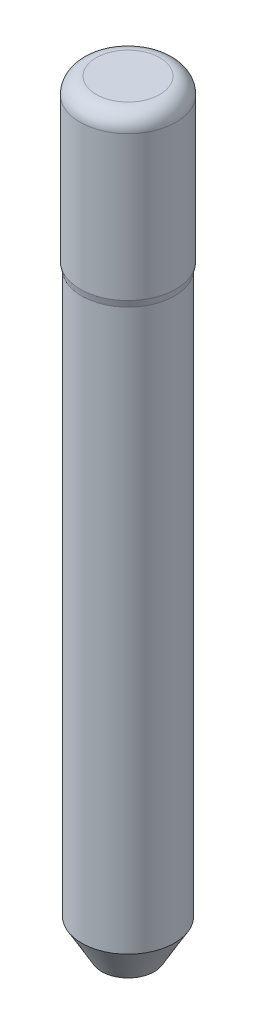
from build123d import *


with BuildPart() as part:
    # Sketch1 → Revolve1 (revolve)
    with BuildSketch(Plane.XY, mode=Mode.PRIVATE) as revolve1_sk:
        with BuildLine():
            Line((0, 0), (0.98444465, 0))
            Line((0.98444465, 0), (1.735, 1.3))
            Line((1.735, 1.3), (1.735, 22.246))
            Line((1.735, 22.246), (1.79, 22.5))
            Line((1.79, 22.5), (1.79, 27.9))
            ThreePointArc((1.79, 27.9), (1.614264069, 28.324264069), (1.19, 28.5))
            Line((1.19, 28.5), (0, 28.5))
            Line((0, 28.5), (0, 0))
        make_face()
    revolve(revolve1_sk.sketch.rotate(Axis((0, 0, 0), (0, 1, 0)), 90), axis=Axis((0, 0, 0), (0, 1, 0)))


solid = part.part
